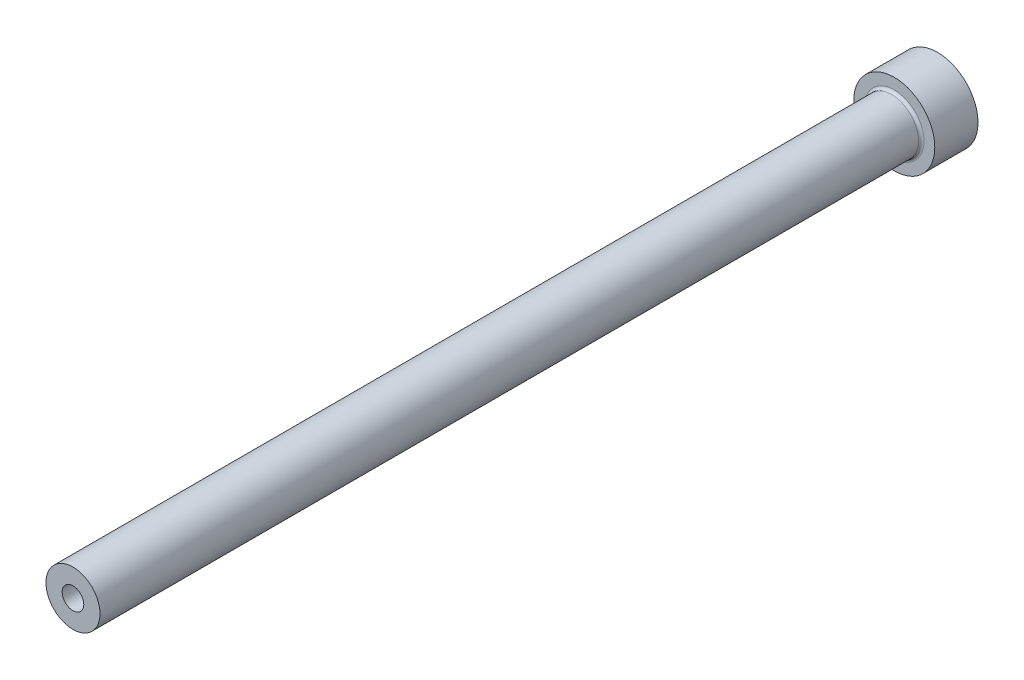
ISO-10303-21;
HEADER;
FILE_DESCRIPTION(('STEP AP214'),'2;1');
FILE_NAME('part.step','',(''),(''),'','','');
FILE_SCHEMA(('AUTOMOTIVE_DESIGN { 1 0 10303 214 1 1 1 1 }'));
ENDSEC;
DATA;
#1=APPLICATION_CONTEXT('core data for automotive mechanical design processes');
#2=APPLICATION_PROTOCOL_DEFINITION('international standard','automotive_design',2000,#1);
#3=PRODUCT_CONTEXT('',#1,'mechanical');
#4=PRODUCT('Part','Part','',(#3));
#5=PRODUCT_RELATED_PRODUCT_CATEGORY('part','',(#4));
#6=PRODUCT_DEFINITION_FORMATION('','',#4);
#7=PRODUCT_DEFINITION_CONTEXT('part definition',#1,'design');
#8=PRODUCT_DEFINITION('design','',#6,#7);
#9=PRODUCT_DEFINITION_SHAPE('','',#8);
#10=(LENGTH_UNIT() NAMED_UNIT(*) SI_UNIT(.MILLI.,.METRE.));
#11=(NAMED_UNIT(*) PLANE_ANGLE_UNIT() SI_UNIT($,.RADIAN.));
#12=(NAMED_UNIT(*) SI_UNIT($,.STERADIAN.) SOLID_ANGLE_UNIT());
#13=UNCERTAINTY_MEASURE_WITH_UNIT(LENGTH_MEASURE(1.E-05),#10,'distance_accuracy_value','');
#14=(GEOMETRIC_REPRESENTATION_CONTEXT(3) GLOBAL_UNCERTAINTY_ASSIGNED_CONTEXT((#13)) GLOBAL_UNIT_ASSIGNED_CONTEXT((#10,
#11,#12)) REPRESENTATION_CONTEXT('',''));
#15=CARTESIAN_POINT('',(0.,0.,0.));
#16=DIRECTION('',(0.,0.,1.));
#17=DIRECTION('',(1.,0.,0.));
#18=AXIS2_PLACEMENT_3D('',#15,#16,#17);
#19=CARTESIAN_POINT('',(0.,0.,160.));
#20=DIRECTION('',(0.,0.,-1.));
#21=DIRECTION('',(-1.,0.,0.));
#22=AXIS2_PLACEMENT_3D('',#19,#20,#21);
#23=PLANE('',#22);
#24=CARTESIAN_POINT('',(0.,0.,160.));
#25=DIRECTION('',(0.,0.,1.));
#26=DIRECTION('',(1.,0.,0.));
#27=AXIS2_PLACEMENT_3D('',#24,#25,#26);
#28=CIRCLE('',#27,1.99999999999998);
#29=CARTESIAN_POINT('',(1.99999999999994,0.,160.));
#30=VERTEX_POINT('',#29);
#31=EDGE_CURVE('E63',#30,#30,#28,.T.);
#32=ORIENTED_EDGE('',*,*,#31,.F.);
#33=EDGE_LOOP('',(#32));
#34=FACE_BOUND('',#33,.T.);
#35=CARTESIAN_POINT('',(0.,0.,160.));
#36=DIRECTION('',(0.,0.,1.));
#37=DIRECTION('',(1.,0.,0.));
#38=AXIS2_PLACEMENT_3D('',#35,#36,#37);
#39=CIRCLE('',#38,4.99999999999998);
#40=CARTESIAN_POINT('',(4.99999999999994,0.,160.));
#41=VERTEX_POINT('',#40);
#42=EDGE_CURVE('E54',#41,#41,#39,.T.);
#43=ORIENTED_EDGE('',*,*,#42,.T.);
#44=EDGE_LOOP('',(#43));
#45=FACE_BOUND('',#44,.T.);
#46=ADVANCED_FACE('F34',(#34,#45),#23,.F.);
#47=CARTESIAN_POINT('',(0.,0.,160.));
#48=DIRECTION('',(0.,0.,1.));
#49=DIRECTION('',(1.,0.,0.));
#50=AXIS2_PLACEMENT_3D('',#47,#48,#49);
#51=CYLINDRICAL_SURFACE('',#50,4.99999999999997);
#52=CARTESIAN_POINT('',(0.,0.,8.50000000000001));
#53=DIRECTION('',(0.,0.,1.));
#54=DIRECTION('',(1.,0.,0.));
#55=AXIS2_PLACEMENT_3D('',#52,#53,#54);
#56=CIRCLE('',#55,4.99999999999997);
#57=CARTESIAN_POINT('',(4.99999999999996,0.,8.50000000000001));
#58=VERTEX_POINT('',#57);
#59=EDGE_CURVE('E49',#58,#58,#56,.T.);
#60=ORIENTED_EDGE('',*,*,#59,.T.);
#61=EDGE_LOOP('',(#60));
#62=FACE_BOUND('',#61,.T.);
#63=ORIENTED_EDGE('',*,*,#42,.F.);
#64=EDGE_LOOP('',(#63));
#65=FACE_BOUND('',#64,.T.);
#66=ADVANCED_FACE('F92',(#62,#65),#51,.T.);
#67=CARTESIAN_POINT('',(0.,0.,7.99999999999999));
#68=DIRECTION('',(0.,0.,1.));
#69=DIRECTION('',(1.,0.,0.));
#70=AXIS2_PLACEMENT_3D('',#67,#68,#69);
#71=PLANE('',#70);
#72=CARTESIAN_POINT('',(0.,0.,7.99999999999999));
#73=DIRECTION('',(0.,0.,1.));
#74=DIRECTION('',(1.,0.,0.));
#75=AXIS2_PLACEMENT_3D('',#72,#73,#74);
#76=CIRCLE('',#75,5.49999999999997);
#77=CARTESIAN_POINT('',(5.49999999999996,0.,8.));
#78=VERTEX_POINT('',#77);
#79=EDGE_CURVE('E45',#78,#78,#76,.F.);
#80=ORIENTED_EDGE('',*,*,#79,.T.);
#81=EDGE_LOOP('',(#80));
#82=FACE_BOUND('',#81,.T.);
#83=CARTESIAN_POINT('',(0.,0.,8.00000000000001));
#84=DIRECTION('',(0.,0.,1.));
#85=DIRECTION('',(1.,0.,0.));
#86=AXIS2_PLACEMENT_3D('',#83,#84,#85);
#87=CIRCLE('',#86,7.49999999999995);
#88=CARTESIAN_POINT('',(7.49999999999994,0.,8.00000000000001));
#89=VERTEX_POINT('',#88);
#90=EDGE_CURVE('E57',#89,#89,#87,.T.);
#91=ORIENTED_EDGE('',*,*,#90,.T.);
#92=EDGE_LOOP('',(#91));
#93=FACE_BOUND('',#92,.T.);
#94=ADVANCED_FACE('F98',(#82,#93),#71,.T.);
#95=CARTESIAN_POINT('',(0.,0.,160.));
#96=DIRECTION('',(0.,0.,1.));
#97=DIRECTION('',(1.,0.,0.));
#98=AXIS2_PLACEMENT_3D('',#95,#96,#97);
#99=CYLINDRICAL_SURFACE('',#98,7.49999999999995);
#100=ORIENTED_EDGE('',*,*,#90,.F.);
#101=EDGE_LOOP('',(#100));
#102=FACE_BOUND('',#101,.T.);
#103=CARTESIAN_POINT('',(0.,0.,0.));
#104=DIRECTION('',(0.,0.,1.));
#105=DIRECTION('',(1.,0.,0.));
#106=AXIS2_PLACEMENT_3D('',#103,#104,#105);
#107=CIRCLE('',#106,7.49999999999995);
#108=CARTESIAN_POINT('',(7.49999999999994,0.,0.));
#109=VERTEX_POINT('',#108);
#110=EDGE_CURVE('E60',#109,#109,#107,.T.);
#111=ORIENTED_EDGE('',*,*,#110,.T.);
#112=EDGE_LOOP('',(#111));
#113=FACE_BOUND('',#112,.T.);
#114=ADVANCED_FACE('F89',(#102,#113),#99,.T.);
#115=CARTESIAN_POINT('',(0.,0.,0.));
#116=DIRECTION('',(0.,0.,1.));
#117=DIRECTION('',(1.,0.,0.));
#118=AXIS2_PLACEMENT_3D('',#115,#116,#117);
#119=PLANE('',#118);
#120=CARTESIAN_POINT('',(0.,0.,0.));
#121=DIRECTION('',(0.,0.,1.));
#122=DIRECTION('',(1.,0.,0.));
#123=AXIS2_PLACEMENT_3D('',#120,#121,#122);
#124=CIRCLE('',#123,2.75);
#125=CARTESIAN_POINT('',(2.74999999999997,0.,0.));
#126=VERTEX_POINT('',#125);
#127=EDGE_CURVE('E41',#126,#126,#124,.T.);
#128=ORIENTED_EDGE('',*,*,#127,.T.);
#129=EDGE_LOOP('',(#128));
#130=FACE_BOUND('',#129,.T.);
#131=ORIENTED_EDGE('',*,*,#110,.F.);
#132=EDGE_LOOP('',(#131));
#133=FACE_BOUND('',#132,.T.);
#134=ADVANCED_FACE('F83',(#130,#133),#119,.F.);
#135=CARTESIAN_POINT('',(0.,0.,160.));
#136=DIRECTION('',(0.,0.,1.));
#137=DIRECTION('',(1.,0.,0.));
#138=AXIS2_PLACEMENT_3D('',#135,#136,#137);
#139=CYLINDRICAL_SURFACE('',#138,1.99999999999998);
#140=ORIENTED_EDGE('',*,*,#31,.T.);
#141=EDGE_LOOP('',(#140));
#142=FACE_BOUND('',#141,.T.);
#143=CARTESIAN_POINT('',(0.,0.,85.));
#144=DIRECTION('',(0.,0.,1.));
#145=DIRECTION('',(1.,0.,0.));
#146=AXIS2_PLACEMENT_3D('',#143,#144,#145);
#147=CIRCLE('',#146,1.99999999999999);
#148=CARTESIAN_POINT('',(1.99999999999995,0.,85.));
#149=VERTEX_POINT('',#148);
#150=EDGE_CURVE('E66',#149,#149,#147,.T.);
#151=ORIENTED_EDGE('',*,*,#150,.F.);
#152=EDGE_LOOP('',(#151));
#153=FACE_BOUND('',#152,.T.);
#154=ADVANCED_FACE('F78',(#142,#153),#139,.F.);
#155=CARTESIAN_POINT('',(0.,0.,85.));
#156=DIRECTION('',(0.,0.,-1.));
#157=DIRECTION('',(-1.,0.,0.));
#158=AXIS2_PLACEMENT_3D('',#155,#156,#157);
#159=CONICAL_SURFACE('',#158,1.99999999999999,0.523598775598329);
#160=CARTESIAN_POINT('',(0.,0.,84.5669872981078));
#161=DIRECTION('',(0.,0.,1.));
#162=DIRECTION('',(1.,0.,0.));
#163=AXIS2_PLACEMENT_3D('',#160,#161,#162);
#164=CIRCLE('',#163,2.24999999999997);
#165=CARTESIAN_POINT('',(2.24999999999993,0.,84.5669872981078));
#166=VERTEX_POINT('',#165);
#167=EDGE_CURVE('E69',#166,#166,#164,.T.);
#168=ORIENTED_EDGE('',*,*,#167,.F.);
#169=EDGE_LOOP('',(#168));
#170=FACE_BOUND('',#169,.T.);
#171=ORIENTED_EDGE('',*,*,#150,.T.);
#172=EDGE_LOOP('',(#171));
#173=FACE_BOUND('',#172,.T.);
#174=ADVANCED_FACE('F75',(#170,#173),#159,.F.);
#175=CARTESIAN_POINT('',(0.,0.,160.));
#176=DIRECTION('',(0.,0.,1.));
#177=DIRECTION('',(1.,0.,0.));
#178=AXIS2_PLACEMENT_3D('',#175,#176,#177);
#179=CYLINDRICAL_SURFACE('',#178,2.24999999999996);
#180=CARTESIAN_POINT('',(0.,0.,0.500000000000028));
#181=DIRECTION('',(0.,0.,1.));
#182=DIRECTION('',(1.,0.,0.));
#183=AXIS2_PLACEMENT_3D('',#180,#181,#182);
#184=CIRCLE('',#183,2.24999999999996);
#185=CARTESIAN_POINT('',(2.24999999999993,0.,0.500000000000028));
#186=VERTEX_POINT('',#185);
#187=EDGE_CURVE('E10',#186,#186,#184,.F.);
#188=ORIENTED_EDGE('',*,*,#187,.T.);
#189=EDGE_LOOP('',(#188));
#190=FACE_BOUND('',#189,.T.);
#191=ORIENTED_EDGE('',*,*,#167,.T.);
#192=EDGE_LOOP('',(#191));
#193=FACE_BOUND('',#192,.T.);
#194=ADVANCED_FACE('F73',(#190,#193),#179,.F.);
#195=CARTESIAN_POINT('',(0.,0.,8.50000000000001));
#196=DIRECTION('',(0.,0.,1.));
#197=DIRECTION('',(1.,0.,0.));
#198=AXIS2_PLACEMENT_3D('',#195,#196,#197);
#199=TOROIDAL_SURFACE('',#198,5.49999999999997,0.5);
#200=ORIENTED_EDGE('',*,*,#79,.F.);
#201=EDGE_LOOP('',(#200));
#202=FACE_BOUND('',#201,.T.);
#203=ORIENTED_EDGE('',*,*,#59,.F.);
#204=EDGE_LOOP('',(#203));
#205=FACE_BOUND('',#204,.T.);
#206=ADVANCED_FACE('F104',(#202,#205),#199,.F.);
#207=CARTESIAN_POINT('',(0.,0.,0.));
#208=DIRECTION('',(0.,0.,-1.));
#209=DIRECTION('',(-1.,0.,0.));
#210=AXIS2_PLACEMENT_3D('',#207,#208,#209);
#211=CONICAL_SURFACE('',#210,2.75,0.78539816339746);
#212=ORIENTED_EDGE('',*,*,#187,.F.);
#213=EDGE_LOOP('',(#212));
#214=FACE_BOUND('',#213,.T.);
#215=ORIENTED_EDGE('',*,*,#127,.F.);
#216=EDGE_LOOP('',(#215));
#217=FACE_BOUND('',#216,.T.);
#218=ADVANCED_FACE('F36',(#214,#217),#211,.F.);
#219=CLOSED_SHELL('',(#46,#66,#94,#114,#134,#154,#174,#194,#206,#218));
#220=MANIFOLD_SOLID_BREP('B2',#219);
#221=ADVANCED_BREP_SHAPE_REPRESENTATION('',(#18,#220),#14);
#222=SHAPE_DEFINITION_REPRESENTATION(#9,#221);
ENDSEC;
END-ISO-10303-21;
